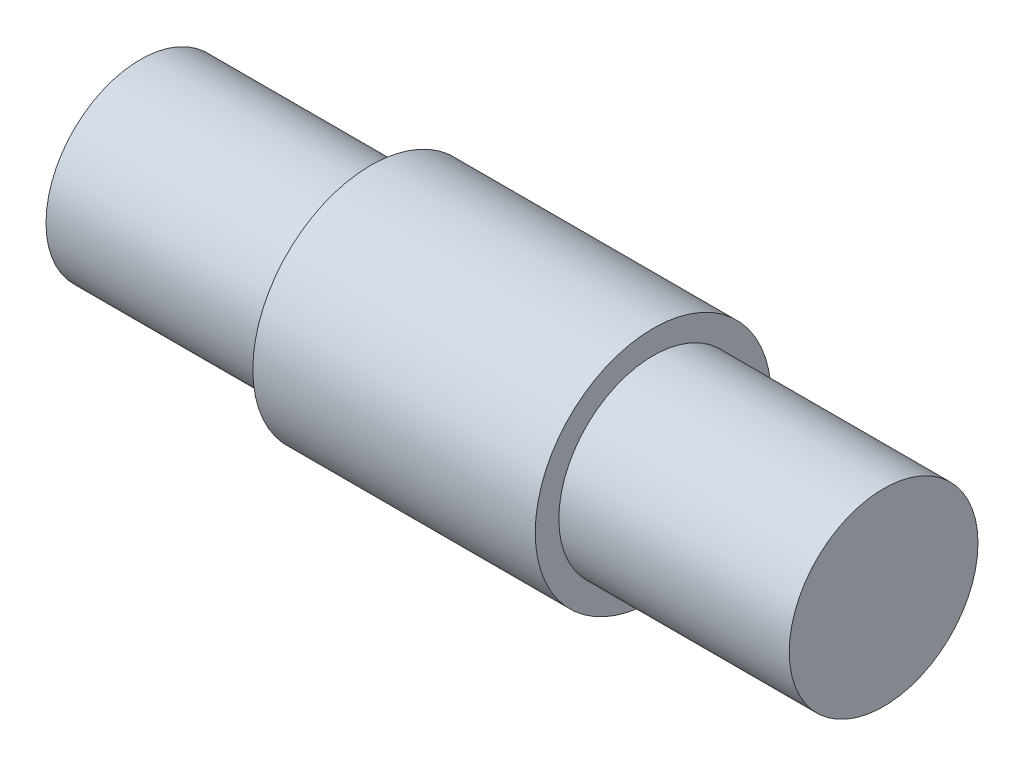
ISO-10303-21;
HEADER;
FILE_DESCRIPTION(('STEP AP214'),'2;1');
FILE_NAME('part.step','',(''),(''),'','','');
FILE_SCHEMA(('AUTOMOTIVE_DESIGN { 1 0 10303 214 1 1 1 1 }'));
ENDSEC;
DATA;
#1=APPLICATION_CONTEXT('core data for automotive mechanical design processes');
#2=APPLICATION_PROTOCOL_DEFINITION('international standard','automotive_design',2000,#1);
#3=PRODUCT_CONTEXT('',#1,'mechanical');
#4=PRODUCT('Part','Part','',(#3));
#5=PRODUCT_RELATED_PRODUCT_CATEGORY('part','',(#4));
#6=PRODUCT_DEFINITION_FORMATION('','',#4);
#7=PRODUCT_DEFINITION_CONTEXT('part definition',#1,'design');
#8=PRODUCT_DEFINITION('design','',#6,#7);
#9=PRODUCT_DEFINITION_SHAPE('','',#8);
#10=(LENGTH_UNIT() NAMED_UNIT(*) SI_UNIT(.MILLI.,.METRE.));
#11=(NAMED_UNIT(*) PLANE_ANGLE_UNIT() SI_UNIT($,.RADIAN.));
#12=(NAMED_UNIT(*) SI_UNIT($,.STERADIAN.) SOLID_ANGLE_UNIT());
#13=UNCERTAINTY_MEASURE_WITH_UNIT(LENGTH_MEASURE(1.E-05),#10,'distance_accuracy_value','');
#14=(GEOMETRIC_REPRESENTATION_CONTEXT(3) GLOBAL_UNCERTAINTY_ASSIGNED_CONTEXT((#13)) GLOBAL_UNIT_ASSIGNED_CONTEXT((#10,
#11,#12)) REPRESENTATION_CONTEXT('',''));
#15=CARTESIAN_POINT('',(0.,0.,0.));
#16=DIRECTION('',(0.,0.,1.));
#17=DIRECTION('',(1.,0.,0.));
#18=AXIS2_PLACEMENT_3D('',#15,#16,#17);
#19=CARTESIAN_POINT('',(-12.5,0.,0.));
#20=DIRECTION('',(1.,0.,0.));
#21=DIRECTION('',(0.,0.,-1.));
#22=AXIS2_PLACEMENT_3D('',#19,#20,#21);
#23=PLANE('',#22);
#24=CARTESIAN_POINT('',(-12.5,0.,0.));
#25=DIRECTION('',(-1.,0.,0.));
#26=DIRECTION('',(0.,0.,1.));
#27=AXIS2_PLACEMENT_3D('',#24,#25,#26);
#28=CIRCLE('',#27,3.175);
#29=CARTESIAN_POINT('',(-12.5,0.,3.175));
#30=VERTEX_POINT('',#29);
#31=EDGE_CURVE('E10',#30,#30,#28,.T.);
#32=ORIENTED_EDGE('',*,*,#31,.T.);
#33=EDGE_LOOP('',(#32));
#34=FACE_BOUND('',#33,.T.);
#35=ADVANCED_FACE('F41',(#34),#23,.F.);
#36=CARTESIAN_POINT('',(-76.4564887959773,0.,0.));
#37=DIRECTION('',(-1.,0.,0.));
#38=DIRECTION('',(0.,0.,1.));
#39=AXIS2_PLACEMENT_3D('',#36,#37,#38);
#40=CYLINDRICAL_SURFACE('',#39,3.175);
#41=ORIENTED_EDGE('',*,*,#31,.F.);
#42=EDGE_LOOP('',(#41));
#43=FACE_BOUND('',#42,.T.);
#44=CARTESIAN_POINT('',(-4.75,0.,0.));
#45=DIRECTION('',(-1.,0.,0.));
#46=DIRECTION('',(0.,0.,1.));
#47=AXIS2_PLACEMENT_3D('',#44,#45,#46);
#48=CIRCLE('',#47,3.175);
#49=CARTESIAN_POINT('',(-4.75,0.,3.175));
#50=VERTEX_POINT('',#49);
#51=EDGE_CURVE('E48',#50,#50,#48,.T.);
#52=ORIENTED_EDGE('',*,*,#51,.T.);
#53=EDGE_LOOP('',(#52));
#54=FACE_BOUND('',#53,.T.);
#55=ADVANCED_FACE('F85',(#43,#54),#40,.T.);
#56=CARTESIAN_POINT('',(-4.75,3.175,0.));
#57=DIRECTION('',(1.,0.,0.));
#58=DIRECTION('',(0.,0.,-1.));
#59=AXIS2_PLACEMENT_3D('',#56,#57,#58);
#60=PLANE('',#59);
#61=ORIENTED_EDGE('',*,*,#51,.F.);
#62=EDGE_LOOP('',(#61));
#63=FACE_BOUND('',#62,.T.);
#64=CARTESIAN_POINT('',(-4.75,0.,0.));
#65=DIRECTION('',(-1.,0.,0.));
#66=DIRECTION('',(0.,0.,1.));
#67=AXIS2_PLACEMENT_3D('',#64,#65,#66);
#68=CIRCLE('',#67,3.96875);
#69=CARTESIAN_POINT('',(-4.75,0.,3.96875));
#70=VERTEX_POINT('',#69);
#71=EDGE_CURVE('E53',#70,#70,#68,.T.);
#72=ORIENTED_EDGE('',*,*,#71,.T.);
#73=EDGE_LOOP('',(#72));
#74=FACE_BOUND('',#73,.T.);
#75=ADVANCED_FACE('F89',(#63,#74),#60,.F.);
#76=CARTESIAN_POINT('',(-76.4564887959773,0.,0.));
#77=DIRECTION('',(-1.,0.,0.));
#78=DIRECTION('',(0.,0.,1.));
#79=AXIS2_PLACEMENT_3D('',#76,#77,#78);
#80=CYLINDRICAL_SURFACE('',#79,3.96875);
#81=ORIENTED_EDGE('',*,*,#71,.F.);
#82=EDGE_LOOP('',(#81));
#83=FACE_BOUND('',#82,.T.);
#84=CARTESIAN_POINT('',(4.75,0.,0.));
#85=DIRECTION('',(-1.,0.,0.));
#86=DIRECTION('',(0.,0.,1.));
#87=AXIS2_PLACEMENT_3D('',#84,#85,#86);
#88=CIRCLE('',#87,3.96875);
#89=CARTESIAN_POINT('',(4.75,0.,3.96875));
#90=VERTEX_POINT('',#89);
#91=EDGE_CURVE('E58',#90,#90,#88,.T.);
#92=ORIENTED_EDGE('',*,*,#91,.T.);
#93=EDGE_LOOP('',(#92));
#94=FACE_BOUND('',#93,.T.);
#95=ADVANCED_FACE('F94',(#83,#94),#80,.T.);
#96=CARTESIAN_POINT('',(4.75,3.96875,0.));
#97=DIRECTION('',(-1.,0.,0.));
#98=DIRECTION('',(0.,0.,1.));
#99=AXIS2_PLACEMENT_3D('',#96,#97,#98);
#100=PLANE('',#99);
#101=ORIENTED_EDGE('',*,*,#91,.F.);
#102=EDGE_LOOP('',(#101));
#103=FACE_BOUND('',#102,.T.);
#104=CARTESIAN_POINT('',(4.75,0.,0.));
#105=DIRECTION('',(-1.,0.,0.));
#106=DIRECTION('',(0.,0.,1.));
#107=AXIS2_PLACEMENT_3D('',#104,#105,#106);
#108=CIRCLE('',#107,3.175);
#109=CARTESIAN_POINT('',(4.75,0.,3.175));
#110=VERTEX_POINT('',#109);
#111=EDGE_CURVE('E64',#110,#110,#108,.T.);
#112=ORIENTED_EDGE('',*,*,#111,.T.);
#113=EDGE_LOOP('',(#112));
#114=FACE_BOUND('',#113,.T.);
#115=ADVANCED_FACE('F81',(#103,#114),#100,.F.);
#116=CARTESIAN_POINT('',(-76.4564887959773,0.,0.));
#117=DIRECTION('',(-1.,0.,0.));
#118=DIRECTION('',(0.,0.,1.));
#119=AXIS2_PLACEMENT_3D('',#116,#117,#118);
#120=CYLINDRICAL_SURFACE('',#119,3.175);
#121=ORIENTED_EDGE('',*,*,#111,.F.);
#122=EDGE_LOOP('',(#121));
#123=FACE_BOUND('',#122,.T.);
#124=CARTESIAN_POINT('',(12.5,0.,0.));
#125=DIRECTION('',(-1.,0.,0.));
#126=DIRECTION('',(0.,0.,1.));
#127=AXIS2_PLACEMENT_3D('',#124,#125,#126);
#128=CIRCLE('',#127,3.175);
#129=CARTESIAN_POINT('',(12.5,0.,3.175));
#130=VERTEX_POINT('',#129);
#131=EDGE_CURVE('E68',#130,#130,#128,.T.);
#132=ORIENTED_EDGE('',*,*,#131,.T.);
#133=EDGE_LOOP('',(#132));
#134=FACE_BOUND('',#133,.T.);
#135=ADVANCED_FACE('F73',(#123,#134),#120,.T.);
#136=CARTESIAN_POINT('',(12.5,3.175,0.));
#137=DIRECTION('',(-1.,0.,0.));
#138=DIRECTION('',(0.,0.,1.));
#139=AXIS2_PLACEMENT_3D('',#136,#137,#138);
#140=PLANE('',#139);
#141=ORIENTED_EDGE('',*,*,#131,.F.);
#142=EDGE_LOOP('',(#141));
#143=FACE_BOUND('',#142,.T.);
#144=ADVANCED_FACE('F75',(#143),#140,.F.);
#145=CLOSED_SHELL('',(#35,#55,#75,#95,#115,#135,#144));
#146=MANIFOLD_SOLID_BREP('B2',#145);
#147=ADVANCED_BREP_SHAPE_REPRESENTATION('',(#18,#146),#14);
#148=SHAPE_DEFINITION_REPRESENTATION(#9,#147);
ENDSEC;
END-ISO-10303-21;
